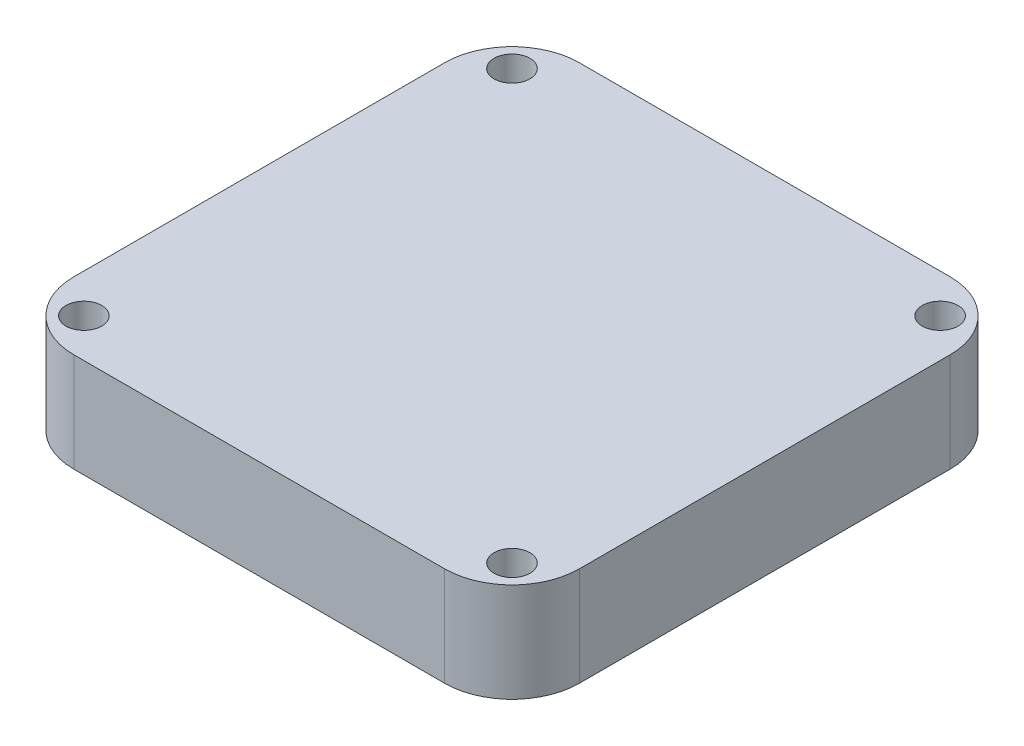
from build123d import *

# Parameters (mm, degrees)
SKETCH1_W                  = 75
SKETCH1_H                  = 75
BOSS_EXTRUDE1_DEPTH        = 14.7
F_4_0_209_DIAMETER_HOLE1_D = 5.3086
FILLET1_R                  = 10


with BuildPart() as part:
    # Sketch1 → Boss-Extrude1 (new body)
    with BuildSketch(Plane(origin=(0, 0, 0), x_dir=(1, 0, 0), z_dir=(0, 1, 0))):
        Rectangle(SKETCH1_W, SKETCH1_H)
    extrude(amount=BOSS_EXTRUDE1_DEPTH)

    # 4 _0.209_ Diameter Hole1 (through all)
    with Locations(Plane(origin=(0, 14.7, 0), x_dir=(1, 0, 0), z_dir=(0, 1, 0))):
        with Locations((-31.75, 31.75), (31.75, -31.75), (31.75, 31.75), (-31.75, -31.75)):
            Hole(F_4_0_209_DIAMETER_HOLE1_D / 2)

    # Fillet1
    fillet1_edges = [part.edges().sort_by_distance(p)[0] for p in [
        (-37.5, 7.35, -37.5),
        (37.5, 7.35, -37.5),
        (37.5, 7.35, 37.5),
        (-37.5, 7.35, 37.5),
    ]]
    fillet(fillet1_edges, radius=FILLET1_R)


solid = part.part
